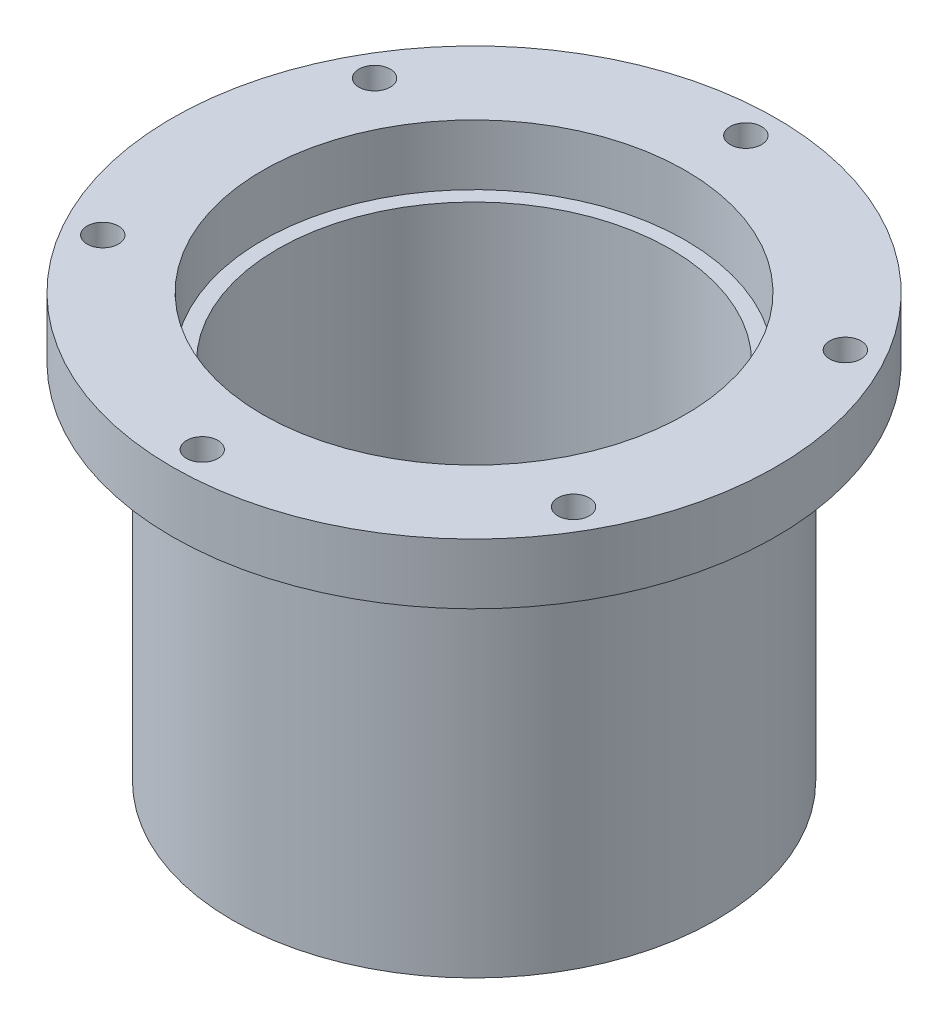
ISO-10303-21;
HEADER;
FILE_DESCRIPTION(('STEP AP214'),'2;1');
FILE_NAME('part.step','',(''),(''),'','','');
FILE_SCHEMA(('AUTOMOTIVE_DESIGN { 1 0 10303 214 1 1 1 1 }'));
ENDSEC;
DATA;
#1=APPLICATION_CONTEXT('core data for automotive mechanical design processes');
#2=APPLICATION_PROTOCOL_DEFINITION('international standard','automotive_design',2000,#1);
#3=PRODUCT_CONTEXT('',#1,'mechanical');
#4=PRODUCT('Part','Part','',(#3));
#5=PRODUCT_RELATED_PRODUCT_CATEGORY('part','',(#4));
#6=PRODUCT_DEFINITION_FORMATION('','',#4);
#7=PRODUCT_DEFINITION_CONTEXT('part definition',#1,'design');
#8=PRODUCT_DEFINITION('design','',#6,#7);
#9=PRODUCT_DEFINITION_SHAPE('','',#8);
#10=(LENGTH_UNIT() NAMED_UNIT(*) SI_UNIT(.MILLI.,.METRE.));
#11=(NAMED_UNIT(*) PLANE_ANGLE_UNIT() SI_UNIT($,.RADIAN.));
#12=(NAMED_UNIT(*) SI_UNIT($,.STERADIAN.) SOLID_ANGLE_UNIT());
#13=UNCERTAINTY_MEASURE_WITH_UNIT(LENGTH_MEASURE(1.E-05),#10,'distance_accuracy_value','');
#14=(GEOMETRIC_REPRESENTATION_CONTEXT(3) GLOBAL_UNCERTAINTY_ASSIGNED_CONTEXT((#13)) GLOBAL_UNIT_ASSIGNED_CONTEXT((#10,
#11,#12)) REPRESENTATION_CONTEXT('',''));
#15=CARTESIAN_POINT('',(0.,0.,0.));
#16=DIRECTION('',(0.,0.,1.));
#17=DIRECTION('',(1.,0.,0.));
#18=AXIS2_PLACEMENT_3D('',#15,#16,#17);
#19=CARTESIAN_POINT('',(0.,77.3658319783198,0.));
#20=DIRECTION('',(0.,1.,0.));
#21=DIRECTION('',(0.,0.,1.));
#22=AXIS2_PLACEMENT_3D('',#19,#20,#21);
#23=CYLINDRICAL_SURFACE('',#22,22.225);
#24=CARTESIAN_POINT('',(0.,0.,0.));
#25=DIRECTION('',(0.,1.,0.));
#26=DIRECTION('',(0.,0.,1.));
#27=AXIS2_PLACEMENT_3D('',#24,#25,#26);
#28=CIRCLE('',#27,22.225);
#29=CARTESIAN_POINT('',(0.,0.,22.225));
#30=VERTEX_POINT('',#29);
#31=EDGE_CURVE('E112',#30,#30,#28,.T.);
#32=ORIENTED_EDGE('',*,*,#31,.F.);
#33=EDGE_LOOP('',(#32));
#34=FACE_BOUND('',#33,.T.);
#35=CARTESIAN_POINT('',(0.,4.7498,0.));
#36=DIRECTION('',(0.,1.,0.));
#37=DIRECTION('',(0.,0.,1.));
#38=AXIS2_PLACEMENT_3D('',#35,#36,#37);
#39=CIRCLE('',#38,22.225);
#40=CARTESIAN_POINT('',(0.,4.7498,22.225));
#41=VERTEX_POINT('',#40);
#42=EDGE_CURVE('E10',#41,#41,#39,.T.);
#43=ORIENTED_EDGE('',*,*,#42,.T.);
#44=EDGE_LOOP('',(#43));
#45=FACE_BOUND('',#44,.T.);
#46=ADVANCED_FACE('F36',(#34,#45),#23,.F.);
#47=CARTESIAN_POINT('',(41.275,4.7498,0.));
#48=DIRECTION('',(0.,-1.,0.));
#49=DIRECTION('',(0.,0.,-1.));
#50=AXIS2_PLACEMENT_3D('',#47,#48,#49);
#51=PLANE('',#50);
#52=CARTESIAN_POINT('',(32.766,4.7498,3.4320583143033E-13));
#53=DIRECTION('',(0.,-1.,0.));
#54=DIRECTION('',(0.,0.,-1.));
#55=AXIS2_PLACEMENT_3D('',#52,#53,#54);
#56=CIRCLE('',#55,3.117806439);
#57=CARTESIAN_POINT('',(32.766,4.7498,-3.11780643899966));
#58=VERTEX_POINT('',#57);
#59=EDGE_CURVE('E91',#58,#58,#56,.T.);
#60=ORIENTED_EDGE('',*,*,#59,.T.);
#61=EDGE_LOOP('',(#60));
#62=FACE_BOUND('',#61,.T.);
#63=CARTESIAN_POINT('',(2.2880388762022E-13,4.7498,-32.766));
#64=DIRECTION('',(0.,-1.,0.));
#65=DIRECTION('',(0.,0.,-1.));
#66=AXIS2_PLACEMENT_3D('',#63,#64,#65);
#67=CIRCLE('',#66,3.117806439);
#68=CARTESIAN_POINT('',(2.2880388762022E-13,4.7498,-35.883806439));
#69=VERTEX_POINT('',#68);
#70=EDGE_CURVE('E97',#69,#69,#67,.T.);
#71=ORIENTED_EDGE('',*,*,#70,.T.);
#72=EDGE_LOOP('',(#71));
#73=FACE_BOUND('',#72,.T.);
#74=CARTESIAN_POINT('',(-32.766,4.7498,-1.1440194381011E-13));
#75=DIRECTION('',(0.,-1.,0.));
#76=DIRECTION('',(0.,0.,-1.));
#77=AXIS2_PLACEMENT_3D('',#74,#75,#76);
#78=CIRCLE('',#77,3.117806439);
#79=CARTESIAN_POINT('',(-32.766,4.7498,-3.11780643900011));
#80=VERTEX_POINT('',#79);
#81=EDGE_CURVE('E103',#80,#80,#78,.T.);
#82=ORIENTED_EDGE('',*,*,#81,.T.);
#83=EDGE_LOOP('',(#82));
#84=FACE_BOUND('',#83,.T.);
#85=CARTESIAN_POINT('',(0.,4.7498,32.766));
#86=DIRECTION('',(0.,-1.,0.));
#87=DIRECTION('',(0.,0.,-1.));
#88=AXIS2_PLACEMENT_3D('',#85,#86,#87);
#89=CIRCLE('',#88,3.117806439);
#90=CARTESIAN_POINT('',(0.,4.7498,29.648193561));
#91=VERTEX_POINT('',#90);
#92=EDGE_CURVE('E109',#91,#91,#89,.T.);
#93=ORIENTED_EDGE('',*,*,#92,.T.);
#94=EDGE_LOOP('',(#93));
#95=FACE_BOUND('',#94,.T.);
#96=ORIENTED_EDGE('',*,*,#42,.F.);
#97=EDGE_LOOP('',(#96));
#98=FACE_BOUND('',#97,.T.);
#99=CARTESIAN_POINT('',(0.,4.7498,0.));
#100=DIRECTION('',(0.,1.,0.));
#101=DIRECTION('',(0.,0.,1.));
#102=AXIS2_PLACEMENT_3D('',#99,#100,#101);
#103=CIRCLE('',#102,41.275);
#104=CARTESIAN_POINT('',(0.,4.7498,41.275));
#105=VERTEX_POINT('',#104);
#106=EDGE_CURVE('E43',#105,#105,#103,.T.);
#107=ORIENTED_EDGE('',*,*,#106,.T.);
#108=EDGE_LOOP('',(#107));
#109=FACE_BOUND('',#108,.T.);
#110=ADVANCED_FACE('F202',(#62,#73,#84,#95,#98,#109),#51,.F.);
#111=CARTESIAN_POINT('',(0.,77.3658319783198,0.));
#112=DIRECTION('',(0.,1.,0.));
#113=DIRECTION('',(0.,0.,1.));
#114=AXIS2_PLACEMENT_3D('',#111,#112,#113);
#115=CYLINDRICAL_SURFACE('',#114,41.275);
#116=ORIENTED_EDGE('',*,*,#106,.F.);
#117=EDGE_LOOP('',(#116));
#118=FACE_BOUND('',#117,.T.);
#119=CARTESIAN_POINT('',(0.,70.993,0.));
#120=DIRECTION('',(0.,1.,0.));
#121=DIRECTION('',(0.,0.,1.));
#122=AXIS2_PLACEMENT_3D('',#119,#120,#121);
#123=CIRCLE('',#122,41.275);
#124=CARTESIAN_POINT('',(0.,70.993,41.275));
#125=VERTEX_POINT('',#124);
#126=EDGE_CURVE('E48',#125,#125,#123,.T.);
#127=ORIENTED_EDGE('',*,*,#126,.T.);
#128=EDGE_LOOP('',(#127));
#129=FACE_BOUND('',#128,.T.);
#130=ADVANCED_FACE('F141',(#118,#129),#115,.F.);
#131=CARTESIAN_POINT('',(44.45,70.993,0.));
#132=DIRECTION('',(0.,-1.,0.));
#133=DIRECTION('',(0.,0.,-1.));
#134=AXIS2_PLACEMENT_3D('',#131,#132,#133);
#135=PLANE('',#134);
#136=ORIENTED_EDGE('',*,*,#126,.F.);
#137=EDGE_LOOP('',(#136));
#138=FACE_BOUND('',#137,.T.);
#139=CARTESIAN_POINT('',(0.,70.993,0.));
#140=DIRECTION('',(0.,1.,0.));
#141=DIRECTION('',(0.,0.,1.));
#142=AXIS2_PLACEMENT_3D('',#139,#140,#141);
#143=CIRCLE('',#142,44.45);
#144=CARTESIAN_POINT('',(0.,70.993,44.45));
#145=VERTEX_POINT('',#144);
#146=EDGE_CURVE('E136',#145,#145,#143,.T.);
#147=ORIENTED_EDGE('',*,*,#146,.T.);
#148=EDGE_LOOP('',(#147));
#149=FACE_BOUND('',#148,.T.);
#150=ADVANCED_FACE('F143',(#138,#149),#135,.F.);
#151=CARTESIAN_POINT('',(0.,77.3658319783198,0.));
#152=DIRECTION('',(0.,1.,0.));
#153=DIRECTION('',(0.,0.,1.));
#154=AXIS2_PLACEMENT_3D('',#151,#152,#153);
#155=CYLINDRICAL_SURFACE('',#154,44.45);
#156=ORIENTED_EDGE('',*,*,#146,.F.);
#157=EDGE_LOOP('',(#156));
#158=FACE_BOUND('',#157,.T.);
#159=CARTESIAN_POINT('',(0.,83.693,0.));
#160=DIRECTION('',(0.,1.,0.));
#161=DIRECTION('',(0.,0.,1.));
#162=AXIS2_PLACEMENT_3D('',#159,#160,#161);
#163=CIRCLE('',#162,44.45);
#164=CARTESIAN_POINT('',(0.,83.693,44.45));
#165=VERTEX_POINT('',#164);
#166=EDGE_CURVE('E133',#165,#165,#163,.T.);
#167=ORIENTED_EDGE('',*,*,#166,.T.);
#168=EDGE_LOOP('',(#167));
#169=FACE_BOUND('',#168,.T.);
#170=ADVANCED_FACE('F146',(#158,#169),#155,.F.);
#171=CARTESIAN_POINT('',(63.5,83.693,0.));
#172=DIRECTION('',(0.,-1.,0.));
#173=DIRECTION('',(0.,0.,-1.));
#174=AXIS2_PLACEMENT_3D('',#171,#172,#173);
#175=PLANE('',#174);
#176=CARTESIAN_POINT('',(-49.4933518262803,83.693,-28.5750000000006));
#177=DIRECTION('',(0.,1.,0.));
#178=DIRECTION('',(0.866025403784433,0.,0.50000000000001));
#179=AXIS2_PLACEMENT_3D('',#176,#177,#178);
#180=CIRCLE('',#179,3.302);
#181=CARTESIAN_POINT('',(-46.6337359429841,83.693,-26.9240000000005));
#182=VERTEX_POINT('',#181);
#183=EDGE_CURVE('E80',#182,#182,#180,.T.);
#184=ORIENTED_EDGE('',*,*,#183,.F.);
#185=EDGE_LOOP('',(#184));
#186=FACE_BOUND('',#185,.T.);
#187=CARTESIAN_POINT('',(-49.4933518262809,83.693,28.5749999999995));
#188=DIRECTION('',(0.,1.,0.));
#189=DIRECTION('',(0.866025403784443,0.,-0.499999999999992));
#190=AXIS2_PLACEMENT_3D('',#187,#188,#189);
#191=CIRCLE('',#190,3.302);
#192=CARTESIAN_POINT('',(-46.6337359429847,83.693,26.9239999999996));
#193=VERTEX_POINT('',#192);
#194=EDGE_CURVE('E70',#193,#193,#191,.T.);
#195=ORIENTED_EDGE('',*,*,#194,.F.);
#196=EDGE_LOOP('',(#195));
#197=FACE_BOUND('',#196,.T.);
#198=CARTESIAN_POINT('',(-3.99076548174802E-13,83.693,57.15));
#199=DIRECTION('',(0.,1.,0.));
#200=DIRECTION('',(0.,0.,-1.));
#201=AXIS2_PLACEMENT_3D('',#198,#199,#200);
#202=CIRCLE('',#201,3.302);
#203=CARTESIAN_POINT('',(-3.76018792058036E-13,83.693,53.848));
#204=VERTEX_POINT('',#203);
#205=EDGE_CURVE('E67',#204,#204,#202,.T.);
#206=ORIENTED_EDGE('',*,*,#205,.F.);
#207=EDGE_LOOP('',(#206));
#208=FACE_BOUND('',#207,.T.);
#209=CARTESIAN_POINT('',(49.4933518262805,83.693,28.5750000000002));
#210=DIRECTION('',(0.,1.,0.));
#211=DIRECTION('',(-0.866025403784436,0.,-0.500000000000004));
#212=AXIS2_PLACEMENT_3D('',#209,#210,#211);
#213=CIRCLE('',#212,3.302);
#214=CARTESIAN_POINT('',(46.6337359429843,83.693,26.9240000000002));
#215=VERTEX_POINT('',#214);
#216=EDGE_CURVE('E64',#215,#215,#213,.T.);
#217=ORIENTED_EDGE('',*,*,#216,.F.);
#218=EDGE_LOOP('',(#217));
#219=FACE_BOUND('',#218,.T.);
#220=CARTESIAN_POINT('',(49.4933518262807,83.693,-28.5749999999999));
#221=DIRECTION('',(0.,1.,0.));
#222=DIRECTION('',(-0.86602540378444,0.,0.499999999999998));
#223=AXIS2_PLACEMENT_3D('',#220,#221,#222);
#224=CIRCLE('',#223,3.302);
#225=CARTESIAN_POINT('',(46.6337359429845,83.693,-26.9239999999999));
#226=VERTEX_POINT('',#225);
#227=EDGE_CURVE('E60',#226,#226,#224,.T.);
#228=ORIENTED_EDGE('',*,*,#227,.F.);
#229=EDGE_LOOP('',(#228));
#230=FACE_BOUND('',#229,.T.);
#231=CARTESIAN_POINT('',(0.,83.693,-57.15));
#232=DIRECTION('',(0.,1.,0.));
#233=DIRECTION('',(0.,0.,1.));
#234=AXIS2_PLACEMENT_3D('',#231,#232,#233);
#235=CIRCLE('',#234,3.302);
#236=CARTESIAN_POINT('',(0.,83.693,-53.848));
#237=VERTEX_POINT('',#236);
#238=EDGE_CURVE('E56',#237,#237,#235,.T.);
#239=ORIENTED_EDGE('',*,*,#238,.F.);
#240=EDGE_LOOP('',(#239));
#241=FACE_BOUND('',#240,.T.);
#242=ORIENTED_EDGE('',*,*,#166,.F.);
#243=EDGE_LOOP('',(#242));
#244=FACE_BOUND('',#243,.T.);
#245=CARTESIAN_POINT('',(0.,83.693,0.));
#246=DIRECTION('',(0.,1.,0.));
#247=DIRECTION('',(0.,0.,1.));
#248=AXIS2_PLACEMENT_3D('',#245,#246,#247);
#249=CIRCLE('',#248,63.5);
#250=CARTESIAN_POINT('',(0.,83.693,63.5));
#251=VERTEX_POINT('',#250);
#252=EDGE_CURVE('E130',#251,#251,#249,.T.);
#253=ORIENTED_EDGE('',*,*,#252,.T.);
#254=EDGE_LOOP('',(#253));
#255=FACE_BOUND('',#254,.T.);
#256=ADVANCED_FACE('F152',(#186,#197,#208,#219,#230,#241,#244,#255),#175,.F.);
#257=CARTESIAN_POINT('',(0.,77.3658319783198,0.));
#258=DIRECTION('',(0.,1.,0.));
#259=DIRECTION('',(0.,0.,1.));
#260=AXIS2_PLACEMENT_3D('',#257,#258,#259);
#261=CYLINDRICAL_SURFACE('',#260,63.5);
#262=ORIENTED_EDGE('',*,*,#252,.F.);
#263=EDGE_LOOP('',(#262));
#264=FACE_BOUND('',#263,.T.);
#265=CARTESIAN_POINT('',(0.,70.993,0.));
#266=DIRECTION('',(0.,1.,0.));
#267=DIRECTION('',(0.,0.,1.));
#268=AXIS2_PLACEMENT_3D('',#265,#266,#267);
#269=CIRCLE('',#268,63.5);
#270=CARTESIAN_POINT('',(0.,70.993,63.5));
#271=VERTEX_POINT('',#270);
#272=EDGE_CURVE('E127',#271,#271,#269,.T.);
#273=ORIENTED_EDGE('',*,*,#272,.T.);
#274=EDGE_LOOP('',(#273));
#275=FACE_BOUND('',#274,.T.);
#276=ADVANCED_FACE('F158',(#264,#275),#261,.T.);
#277=CARTESIAN_POINT('',(50.8,70.993,0.));
#278=DIRECTION('',(0.,1.,0.));
#279=DIRECTION('',(0.,0.,1.));
#280=AXIS2_PLACEMENT_3D('',#277,#278,#279);
#281=PLANE('',#280);
#282=CARTESIAN_POINT('',(-49.4933518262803,70.993,-28.5750000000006));
#283=DIRECTION('',(0.,1.,0.));
#284=DIRECTION('',(0.,0.,1.));
#285=AXIS2_PLACEMENT_3D('',#282,#283,#284);
#286=CIRCLE('',#285,3.302);
#287=CARTESIAN_POINT('',(-49.4933518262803,70.993,-25.2730000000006));
#288=VERTEX_POINT('',#287);
#289=EDGE_CURVE('E39',#288,#288,#286,.T.);
#290=ORIENTED_EDGE('',*,*,#289,.T.);
#291=EDGE_LOOP('',(#290));
#292=FACE_BOUND('',#291,.T.);
#293=CARTESIAN_POINT('',(-49.4933518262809,70.993,28.5749999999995));
#294=DIRECTION('',(0.,1.,0.));
#295=DIRECTION('',(0.,0.,1.));
#296=AXIS2_PLACEMENT_3D('',#293,#294,#295);
#297=CIRCLE('',#296,3.302);
#298=CARTESIAN_POINT('',(-49.4933518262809,70.993,31.8769999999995));
#299=VERTEX_POINT('',#298);
#300=EDGE_CURVE('E68',#299,#299,#297,.T.);
#301=ORIENTED_EDGE('',*,*,#300,.T.);
#302=EDGE_LOOP('',(#301));
#303=FACE_BOUND('',#302,.T.);
#304=CARTESIAN_POINT('',(-3.99076548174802E-13,70.993,57.15));
#305=DIRECTION('',(0.,1.,0.));
#306=DIRECTION('',(0.,0.,1.));
#307=AXIS2_PLACEMENT_3D('',#304,#305,#306);
#308=CIRCLE('',#307,3.302);
#309=CARTESIAN_POINT('',(-3.99076548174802E-13,70.993,60.452));
#310=VERTEX_POINT('',#309);
#311=EDGE_CURVE('E65',#310,#310,#308,.T.);
#312=ORIENTED_EDGE('',*,*,#311,.T.);
#313=EDGE_LOOP('',(#312));
#314=FACE_BOUND('',#313,.T.);
#315=CARTESIAN_POINT('',(49.4933518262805,70.993,28.5750000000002));
#316=DIRECTION('',(0.,1.,0.));
#317=DIRECTION('',(0.,0.,1.));
#318=AXIS2_PLACEMENT_3D('',#315,#316,#317);
#319=CIRCLE('',#318,3.302);
#320=CARTESIAN_POINT('',(49.4933518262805,70.993,31.8770000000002));
#321=VERTEX_POINT('',#320);
#322=EDGE_CURVE('E61',#321,#321,#319,.T.);
#323=ORIENTED_EDGE('',*,*,#322,.T.);
#324=EDGE_LOOP('',(#323));
#325=FACE_BOUND('',#324,.T.);
#326=CARTESIAN_POINT('',(49.4933518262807,70.993,-28.5749999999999));
#327=DIRECTION('',(0.,1.,0.));
#328=DIRECTION('',(0.,0.,1.));
#329=AXIS2_PLACEMENT_3D('',#326,#327,#328);
#330=CIRCLE('',#329,3.302);
#331=CARTESIAN_POINT('',(49.4933518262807,70.993,-25.2729999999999));
#332=VERTEX_POINT('',#331);
#333=EDGE_CURVE('E57',#332,#332,#330,.T.);
#334=ORIENTED_EDGE('',*,*,#333,.T.);
#335=EDGE_LOOP('',(#334));
#336=FACE_BOUND('',#335,.T.);
#337=CARTESIAN_POINT('',(0.,70.993,-57.15));
#338=DIRECTION('',(0.,1.,0.));
#339=DIRECTION('',(0.,0.,1.));
#340=AXIS2_PLACEMENT_3D('',#337,#338,#339);
#341=CIRCLE('',#340,3.302);
#342=CARTESIAN_POINT('',(0.,70.993,-53.848));
#343=VERTEX_POINT('',#342);
#344=EDGE_CURVE('E52',#343,#343,#341,.T.);
#345=ORIENTED_EDGE('',*,*,#344,.T.);
#346=EDGE_LOOP('',(#345));
#347=FACE_BOUND('',#346,.T.);
#348=ORIENTED_EDGE('',*,*,#272,.F.);
#349=EDGE_LOOP('',(#348));
#350=FACE_BOUND('',#349,.T.);
#351=CARTESIAN_POINT('',(0.,70.993,0.));
#352=DIRECTION('',(0.,1.,0.));
#353=DIRECTION('',(0.,0.,1.));
#354=AXIS2_PLACEMENT_3D('',#351,#352,#353);
#355=CIRCLE('',#354,50.8);
#356=CARTESIAN_POINT('',(0.,70.993,50.8));
#357=VERTEX_POINT('',#356);
#358=EDGE_CURVE('E124',#357,#357,#355,.T.);
#359=ORIENTED_EDGE('',*,*,#358,.T.);
#360=EDGE_LOOP('',(#359));
#361=FACE_BOUND('',#360,.T.);
#362=ADVANCED_FACE('F165',(#292,#303,#314,#325,#336,#347,#350,#361),#281,.F.);
#363=CARTESIAN_POINT('',(0.,77.3658319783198,0.));
#364=DIRECTION('',(0.,1.,0.));
#365=DIRECTION('',(0.,0.,1.));
#366=AXIS2_PLACEMENT_3D('',#363,#364,#365);
#367=CYLINDRICAL_SURFACE('',#366,50.8);
#368=ORIENTED_EDGE('',*,*,#358,.F.);
#369=EDGE_LOOP('',(#368));
#370=FACE_BOUND('',#369,.T.);
#371=CARTESIAN_POINT('',(0.,-5.207,0.));
#372=DIRECTION('',(0.,1.,0.));
#373=DIRECTION('',(0.,0.,1.));
#374=AXIS2_PLACEMENT_3D('',#371,#372,#373);
#375=CIRCLE('',#374,50.8);
#376=CARTESIAN_POINT('',(0.,-5.207,50.8));
#377=VERTEX_POINT('',#376);
#378=EDGE_CURVE('E121',#377,#377,#375,.T.);
#379=ORIENTED_EDGE('',*,*,#378,.T.);
#380=EDGE_LOOP('',(#379));
#381=FACE_BOUND('',#380,.T.);
#382=ADVANCED_FACE('F171',(#370,#381),#367,.T.);
#383=CARTESIAN_POINT('',(25.2222,-5.207,0.));
#384=DIRECTION('',(0.,1.,0.));
#385=DIRECTION('',(0.,0.,1.));
#386=AXIS2_PLACEMENT_3D('',#383,#384,#385);
#387=PLANE('',#386);
#388=CARTESIAN_POINT('',(32.766,-5.207,3.4320583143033E-13));
#389=DIRECTION('',(0.,-1.,0.));
#390=DIRECTION('',(-1.,0.,0.));
#391=AXIS2_PLACEMENT_3D('',#388,#389,#390);
#392=CIRCLE('',#391,3.117806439);
#393=CARTESIAN_POINT('',(29.648193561,-5.207,3.10548523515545E-13));
#394=VERTEX_POINT('',#393);
#395=EDGE_CURVE('E55',#394,#394,#392,.T.);
#396=ORIENTED_EDGE('',*,*,#395,.F.);
#397=EDGE_LOOP('',(#396));
#398=FACE_BOUND('',#397,.T.);
#399=CARTESIAN_POINT('',(2.2880388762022E-13,-5.207,-32.766));
#400=DIRECTION('',(0.,-1.,0.));
#401=DIRECTION('',(0.,0.,1.));
#402=AXIS2_PLACEMENT_3D('',#399,#400,#401);
#403=CIRCLE('',#402,3.117806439);
#404=CARTESIAN_POINT('',(2.07032349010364E-13,-5.207,-29.648193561));
#405=VERTEX_POINT('',#404);
#406=EDGE_CURVE('E94',#405,#405,#403,.T.);
#407=ORIENTED_EDGE('',*,*,#406,.F.);
#408=EDGE_LOOP('',(#407));
#409=FACE_BOUND('',#408,.T.);
#410=CARTESIAN_POINT('',(-32.766,-5.207,-1.1440194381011E-13));
#411=DIRECTION('',(0.,-1.,0.));
#412=DIRECTION('',(1.,0.,0.));
#413=AXIS2_PLACEMENT_3D('',#410,#411,#412);
#414=CIRCLE('',#413,3.117806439);
#415=CARTESIAN_POINT('',(-29.648193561,-5.207,-1.03516174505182E-13));
#416=VERTEX_POINT('',#415);
#417=EDGE_CURVE('E100',#416,#416,#414,.T.);
#418=ORIENTED_EDGE('',*,*,#417,.F.);
#419=EDGE_LOOP('',(#418));
#420=FACE_BOUND('',#419,.T.);
#421=CARTESIAN_POINT('',(0.,-5.207,32.766));
#422=DIRECTION('',(0.,-1.,0.));
#423=DIRECTION('',(0.,0.,-1.));
#424=AXIS2_PLACEMENT_3D('',#421,#422,#423);
#425=CIRCLE('',#424,3.117806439);
#426=CARTESIAN_POINT('',(0.,-5.207,29.648193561));
#427=VERTEX_POINT('',#426);
#428=EDGE_CURVE('E106',#427,#427,#425,.T.);
#429=ORIENTED_EDGE('',*,*,#428,.F.);
#430=EDGE_LOOP('',(#429));
#431=FACE_BOUND('',#430,.T.);
#432=ORIENTED_EDGE('',*,*,#378,.F.);
#433=EDGE_LOOP('',(#432));
#434=FACE_BOUND('',#433,.T.);
#435=CARTESIAN_POINT('',(0.,-5.207,0.));
#436=DIRECTION('',(0.,1.,0.));
#437=DIRECTION('',(0.,0.,1.));
#438=AXIS2_PLACEMENT_3D('',#435,#436,#437);
#439=CIRCLE('',#438,25.2222);
#440=CARTESIAN_POINT('',(0.,-5.207,25.2222));
#441=VERTEX_POINT('',#440);
#442=EDGE_CURVE('E118',#441,#441,#439,.T.);
#443=ORIENTED_EDGE('',*,*,#442,.T.);
#444=EDGE_LOOP('',(#443));
#445=FACE_BOUND('',#444,.T.);
#446=ADVANCED_FACE('F178',(#398,#409,#420,#431,#434,#445),#387,.F.);
#447=CARTESIAN_POINT('',(0.,77.3658319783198,0.));
#448=DIRECTION('',(0.,1.,0.));
#449=DIRECTION('',(0.,0.,1.));
#450=AXIS2_PLACEMENT_3D('',#447,#448,#449);
#451=CYLINDRICAL_SURFACE('',#450,25.2222);
#452=ORIENTED_EDGE('',*,*,#442,.F.);
#453=EDGE_LOOP('',(#452));
#454=FACE_BOUND('',#453,.T.);
#455=CARTESIAN_POINT('',(0.,0.,0.));
#456=DIRECTION('',(0.,1.,0.));
#457=DIRECTION('',(0.,0.,1.));
#458=AXIS2_PLACEMENT_3D('',#455,#456,#457);
#459=CIRCLE('',#458,25.2222);
#460=CARTESIAN_POINT('',(0.,0.,25.2222));
#461=VERTEX_POINT('',#460);
#462=EDGE_CURVE('E115',#461,#461,#459,.T.);
#463=ORIENTED_EDGE('',*,*,#462,.T.);
#464=EDGE_LOOP('',(#463));
#465=FACE_BOUND('',#464,.T.);
#466=ADVANCED_FACE('F184',(#454,#465),#451,.F.);
#467=CARTESIAN_POINT('',(22.225,0.,0.));
#468=DIRECTION('',(0.,1.,0.));
#469=DIRECTION('',(0.,0.,1.));
#470=AXIS2_PLACEMENT_3D('',#467,#468,#469);
#471=PLANE('',#470);
#472=ORIENTED_EDGE('',*,*,#462,.F.);
#473=EDGE_LOOP('',(#472));
#474=FACE_BOUND('',#473,.T.);
#475=ORIENTED_EDGE('',*,*,#31,.T.);
#476=EDGE_LOOP('',(#475));
#477=FACE_BOUND('',#476,.T.);
#478=ADVANCED_FACE('F191',(#474,#477),#471,.F.);
#479=CARTESIAN_POINT('',(0.,83.693,32.766));
#480=DIRECTION('',(0.,-1.,0.));
#481=DIRECTION('',(0.,0.,-1.));
#482=AXIS2_PLACEMENT_3D('',#479,#480,#481);
#483=CYLINDRICAL_SURFACE('',#482,3.117806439);
#484=ORIENTED_EDGE('',*,*,#428,.T.);
#485=EDGE_LOOP('',(#484));
#486=FACE_BOUND('',#485,.T.);
#487=ORIENTED_EDGE('',*,*,#92,.F.);
#488=EDGE_LOOP('',(#487));
#489=FACE_BOUND('',#488,.T.);
#490=ADVANCED_FACE('F197',(#486,#489),#483,.F.);
#491=CARTESIAN_POINT('',(-32.766,83.693,-1.1440194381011E-13));
#492=DIRECTION('',(0.,-1.,0.));
#493=DIRECTION('',(0.,0.,-1.));
#494=AXIS2_PLACEMENT_3D('',#491,#492,#493);
#495=CYLINDRICAL_SURFACE('',#494,3.117806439);
#496=ORIENTED_EDGE('',*,*,#417,.T.);
#497=EDGE_LOOP('',(#496));
#498=FACE_BOUND('',#497,.T.);
#499=ORIENTED_EDGE('',*,*,#81,.F.);
#500=EDGE_LOOP('',(#499));
#501=FACE_BOUND('',#500,.T.);
#502=ADVANCED_FACE('F216',(#498,#501),#495,.F.);
#503=CARTESIAN_POINT('',(2.2880388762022E-13,83.693,-32.766));
#504=DIRECTION('',(0.,-1.,0.));
#505=DIRECTION('',(0.,0.,-1.));
#506=AXIS2_PLACEMENT_3D('',#503,#504,#505);
#507=CYLINDRICAL_SURFACE('',#506,3.117806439);
#508=ORIENTED_EDGE('',*,*,#406,.T.);
#509=EDGE_LOOP('',(#508));
#510=FACE_BOUND('',#509,.T.);
#511=ORIENTED_EDGE('',*,*,#70,.F.);
#512=EDGE_LOOP('',(#511));
#513=FACE_BOUND('',#512,.T.);
#514=ADVANCED_FACE('F220',(#510,#513),#507,.F.);
#515=CARTESIAN_POINT('',(32.766,83.693,3.4320583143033E-13));
#516=DIRECTION('',(0.,-1.,0.));
#517=DIRECTION('',(0.,0.,-1.));
#518=AXIS2_PLACEMENT_3D('',#515,#516,#517);
#519=CYLINDRICAL_SURFACE('',#518,3.117806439);
#520=ORIENTED_EDGE('',*,*,#395,.T.);
#521=EDGE_LOOP('',(#520));
#522=FACE_BOUND('',#521,.T.);
#523=ORIENTED_EDGE('',*,*,#59,.F.);
#524=EDGE_LOOP('',(#523));
#525=FACE_BOUND('',#524,.T.);
#526=ADVANCED_FACE('F224',(#522,#525),#519,.F.);
#527=CARTESIAN_POINT('',(0.,-5.207,-57.15));
#528=DIRECTION('',(0.,1.,0.));
#529=DIRECTION('',(0.,0.,1.));
#530=AXIS2_PLACEMENT_3D('',#527,#528,#529);
#531=CYLINDRICAL_SURFACE('',#530,3.302);
#532=ORIENTED_EDGE('',*,*,#238,.T.);
#533=EDGE_LOOP('',(#532));
#534=FACE_BOUND('',#533,.T.);
#535=ORIENTED_EDGE('',*,*,#344,.F.);
#536=EDGE_LOOP('',(#535));
#537=FACE_BOUND('',#536,.T.);
#538=ADVANCED_FACE('F228',(#534,#537),#531,.F.);
#539=CARTESIAN_POINT('',(49.4933518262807,-5.207,-28.5749999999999));
#540=DIRECTION('',(0.,1.,0.));
#541=DIRECTION('',(0.,0.,1.));
#542=AXIS2_PLACEMENT_3D('',#539,#540,#541);
#543=CYLINDRICAL_SURFACE('',#542,3.302);
#544=ORIENTED_EDGE('',*,*,#227,.T.);
#545=EDGE_LOOP('',(#544));
#546=FACE_BOUND('',#545,.T.);
#547=ORIENTED_EDGE('',*,*,#333,.F.);
#548=EDGE_LOOP('',(#547));
#549=FACE_BOUND('',#548,.T.);
#550=ADVANCED_FACE('F232',(#546,#549),#543,.F.);
#551=CARTESIAN_POINT('',(49.4933518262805,-5.207,28.5750000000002));
#552=DIRECTION('',(0.,1.,0.));
#553=DIRECTION('',(0.,0.,1.));
#554=AXIS2_PLACEMENT_3D('',#551,#552,#553);
#555=CYLINDRICAL_SURFACE('',#554,3.302);
#556=ORIENTED_EDGE('',*,*,#216,.T.);
#557=EDGE_LOOP('',(#556));
#558=FACE_BOUND('',#557,.T.);
#559=ORIENTED_EDGE('',*,*,#322,.F.);
#560=EDGE_LOOP('',(#559));
#561=FACE_BOUND('',#560,.T.);
#562=ADVANCED_FACE('F236',(#558,#561),#555,.F.);
#563=CARTESIAN_POINT('',(-3.99076548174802E-13,-5.207,57.15));
#564=DIRECTION('',(0.,1.,0.));
#565=DIRECTION('',(0.,0.,1.));
#566=AXIS2_PLACEMENT_3D('',#563,#564,#565);
#567=CYLINDRICAL_SURFACE('',#566,3.302);
#568=ORIENTED_EDGE('',*,*,#205,.T.);
#569=EDGE_LOOP('',(#568));
#570=FACE_BOUND('',#569,.T.);
#571=ORIENTED_EDGE('',*,*,#311,.F.);
#572=EDGE_LOOP('',(#571));
#573=FACE_BOUND('',#572,.T.);
#574=ADVANCED_FACE('F240',(#570,#573),#567,.F.);
#575=CARTESIAN_POINT('',(-49.4933518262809,-5.207,28.5749999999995));
#576=DIRECTION('',(0.,1.,0.));
#577=DIRECTION('',(0.,0.,1.));
#578=AXIS2_PLACEMENT_3D('',#575,#576,#577);
#579=CYLINDRICAL_SURFACE('',#578,3.302);
#580=ORIENTED_EDGE('',*,*,#194,.T.);
#581=EDGE_LOOP('',(#580));
#582=FACE_BOUND('',#581,.T.);
#583=ORIENTED_EDGE('',*,*,#300,.F.);
#584=EDGE_LOOP('',(#583));
#585=FACE_BOUND('',#584,.T.);
#586=ADVANCED_FACE('F244',(#582,#585),#579,.F.);
#587=CARTESIAN_POINT('',(-49.4933518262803,-5.207,-28.5750000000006));
#588=DIRECTION('',(0.,1.,0.));
#589=DIRECTION('',(0.,0.,1.));
#590=AXIS2_PLACEMENT_3D('',#587,#588,#589);
#591=CYLINDRICAL_SURFACE('',#590,3.302);
#592=ORIENTED_EDGE('',*,*,#183,.T.);
#593=EDGE_LOOP('',(#592));
#594=FACE_BOUND('',#593,.T.);
#595=ORIENTED_EDGE('',*,*,#289,.F.);
#596=EDGE_LOOP('',(#595));
#597=FACE_BOUND('',#596,.T.);
#598=ADVANCED_FACE('F248',(#594,#597),#591,.F.);
#599=CLOSED_SHELL('',(#46,#110,#130,#150,#170,#256,#276,#362,#382,#446,#466,#478,#490,#502,#514,
#526,#538,#550,#562,#574,#586,#598));
#600=MANIFOLD_SOLID_BREP('B2',#599);
#601=ADVANCED_BREP_SHAPE_REPRESENTATION('',(#18,#600),#14);
#602=SHAPE_DEFINITION_REPRESENTATION(#9,#601);
ENDSEC;
END-ISO-10303-21;
